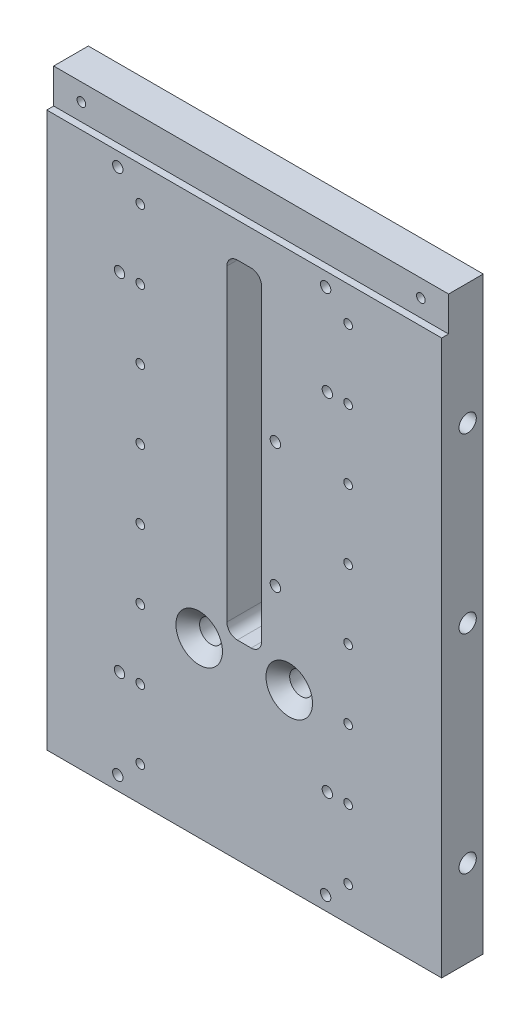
from build123d import *

# Parameters (mm, degrees)
SKETCH1_W                     = 114
SKETCH1_H                     = 170
BOSS_EXTRUDE1_DEPTH           = 6
SKETCH3_W                     = 10
SKETCH3_H                     = 95
CUT_EXTRUDE2_DEPTH            = 104.043680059
FILLET1_R                     = 3
SKETCH12_W                    = 2
SKETCH12_H                    = 10
CUT_EXTRUDE3_DEPTH            = 143.327088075
M3X0_5_TAPPED_HOLE4_D         = 2.5
M3X0_5_TAPPED_HOLE4_DEPTH     = 7.5
M3X0_5_TAPPED_HOLE4_TIP       = 0.751075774
F_3_0_3_DIAMETER_HOLE1_D      = 3
F_3_0_3_DIAMETER_HOLE3_D      = 3
M6X1_0_TAPPED_HOLE1_D         = 5
M6X1_0_TAPPED_HOLE1_DEPTH     = 15
M6X1_0_TAPPED_HOLE1_TIP       = 1.502151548
M6X1_0_TAPPED_HOLE2_D         = 5
M6X1_0_TAPPED_HOLE2_DEPTH     = 15
M6X1_0_TAPPED_HOLE2_TIP       = 1.502151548
CSK_FOR_M6_SFHCS1_D           = 6.6
CSK_FOR_M6_SFHCS1_CSINK_D     = 13.44
CSK_FOR_M6_SFHCS1_CSINK_ANGLE = 90
M3X0_5_TAPPED_HOLE2_D         = 2.5
M3X0_5_TAPPED_HOLE2_DEPTH     = 7.5
M3X0_5_TAPPED_HOLE2_TIP       = 0.751075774
M3X0_5_TAPPED_HOLE3_D         = 2.5
M3X0_5_TAPPED_HOLE3_DEPTH     = 4.3
M3X0_5_TAPPED_HOLE3_TIP       = 0.751075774
F_3_0_3_DIAMETER_HOLE4_D      = 3
F_3_0_3_DIAMETER_HOLE5_D      = 3


with BuildPart() as part:
    # Sketch1 → Boss-Extrude1 (new, symmetric)
    with BuildSketch(Plane.XY):
        Rectangle(SKETCH1_W, SKETCH1_H)
    extrude(amount=BOSS_EXTRUDE1_DEPTH, both=True)

    # Sketch3 → Cut-Extrude2 (cut, through all)
    with BuildSketch(Plane(origin=(0, 0, -6), x_dir=(-1, 0, 0), z_dir=(0, 0, -1))):
        with Locations((0, 17.5)):
            Rectangle(SKETCH3_W, SKETCH3_H)
    extrude(amount=-CUT_EXTRUDE2_DEPTH, mode=Mode.SUBTRACT)

    # Fillet1
    fillet1_edges = [part.edges().sort_by_distance(p)[0] for p in [
        (5, -30, 0),
        (5, 65, 0),
        (-5, 65, 0),
        (-5, -30, 0),
    ]]
    fillet(fillet1_edges, radius=FILLET1_R)

    # Sketch12 → Cut-Extrude3 (cut, through all)
    with BuildSketch(Plane(origin=(57, 0, 0), x_dir=(0, 0, -1), z_dir=(1, 0, 0))):
        with Locations((-5, 80)):
            Rectangle(SKETCH12_W, SKETCH12_H)
    extrude(amount=-CUT_EXTRUDE3_DEPTH, mode=Mode.SUBTRACT)

    # M3x0.5 Tapped Hole4
    with Locations(Plane.XY.offset(6)):
        with Locations((-49, 80), (49, 80)):
            Hole(M3X0_5_TAPPED_HOLE4_D / 2, depth=M3X0_5_TAPPED_HOLE4_DEPTH)
            with Locations((0, 0, -(M3X0_5_TAPPED_HOLE4_DEPTH + M3X0_5_TAPPED_HOLE4_TIP / 2))):  # 118° drill point
                Cone(0, M3X0_5_TAPPED_HOLE4_D / 2, M3X0_5_TAPPED_HOLE4_TIP, mode=Mode.SUBTRACT)

    # 3.0 _3_ Diameter Hole1 (through all)
    with Locations(Plane(origin=(0, 0, -6), x_dir=(-1, 0, 0), z_dir=(0, 0, -1))):
        with Locations((-9, -11)):
            Hole(F_3_0_3_DIAMETER_HOLE1_D / 2)

    # 3.0 _3_ Diameter Hole3 (through all)
    with Locations(Plane(origin=(0, 0, -6), x_dir=(-1, 0, 0), z_dir=(0, 0, -1))):
        with Locations((-9, 25)):
            Hole(F_3_0_3_DIAMETER_HOLE3_D / 2)

    # M6x1.0 Tapped Hole1
    with Locations(Plane(origin=(57, 0, 0), x_dir=(0, 0, -1), z_dir=(1, 0, 0))):
        with Locations((1.5, 50), (1.5, 0), (1.5, -60)):
            Hole(M6X1_0_TAPPED_HOLE1_D / 2, depth=M6X1_0_TAPPED_HOLE1_DEPTH)
            with Locations((0, 0, -(M6X1_0_TAPPED_HOLE1_DEPTH + M6X1_0_TAPPED_HOLE1_TIP / 2))):  # 118° drill point
                Cone(0, M6X1_0_TAPPED_HOLE1_D / 2, M6X1_0_TAPPED_HOLE1_TIP, mode=Mode.SUBTRACT)

    # M6x1.0 Tapped Hole2
    with Locations(Plane.ZY.offset(57)):
        with Locations((-1.5, 50), (-1.5, 0), (-1.5, -60)):
            Hole(M6X1_0_TAPPED_HOLE2_D / 2, depth=M6X1_0_TAPPED_HOLE2_DEPTH)
            with Locations((0, 0, -(M6X1_0_TAPPED_HOLE2_DEPTH + M6X1_0_TAPPED_HOLE2_TIP / 2))):  # 118° drill point
                Cone(0, M6X1_0_TAPPED_HOLE2_D / 2, M6X1_0_TAPPED_HOLE2_TIP, mode=Mode.SUBTRACT)

    # CSK for M6 SFHCS1 (through all)
    with Locations(Plane.XY.offset(6)):
        with Locations((-13, -35), (13, -35)):
            CounterSinkHole(CSK_FOR_M6_SFHCS1_D / 2, CSK_FOR_M6_SFHCS1_CSINK_D / 2, counter_sink_angle=CSK_FOR_M6_SFHCS1_CSINK_ANGLE)

    # M3x0.5 Tapped Hole2
    with Locations(Plane(origin=(0, 0, -6), x_dir=(-1, 0, 0), z_dir=(0, 0, -1))):
        with Locations((38.404204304, 57.5), (38.404204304, 17.5), (38.404204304, -22.5)):
            Hole(M3X0_5_TAPPED_HOLE2_D / 2, depth=M3X0_5_TAPPED_HOLE2_DEPTH)
            with Locations((0, 0, -(M3X0_5_TAPPED_HOLE2_DEPTH + M3X0_5_TAPPED_HOLE2_TIP / 2))):  # 118° drill point
                Cone(0, M3X0_5_TAPPED_HOLE2_D / 2, M3X0_5_TAPPED_HOLE2_TIP, mode=Mode.SUBTRACT)

    # M3x0.5 Tapped Hole3
    with Locations(Plane.XY.offset(6)):
        with Locations((-30, 65), (-30, 45), (-30, 25), (-30, 5), (-30, -15), (-30, -35), (-30, -55), (-30, -75), (30, -75), (30, -55), (30, -35), (30, -15), (30, 5), (30, 25), (30, 45), (30, 65)):
            Hole(M3X0_5_TAPPED_HOLE3_D / 2, depth=M3X0_5_TAPPED_HOLE3_DEPTH)
            with Locations((0, 0, -(M3X0_5_TAPPED_HOLE3_DEPTH + M3X0_5_TAPPED_HOLE3_TIP / 2))):  # 118° drill point
                Cone(0, M3X0_5_TAPPED_HOLE3_D / 2, M3X0_5_TAPPED_HOLE3_TIP, mode=Mode.SUBTRACT)

    # 3.0 _3_ Diameter Hole4 (through all)
    with Locations(Plane.XY.offset(6)):
        with Locations((-36, 45), (24, 45), (24, -55), (-36, -55)):
            Hole(F_3_0_3_DIAMETER_HOLE4_D / 2)

    # 3.0 _3_ Diameter Hole5 (through all)
    with Locations(Plane.XY.offset(6)):
        with Locations((-36.5, 71), (-36.5, -81), (23.5, -81), (23.5, 71)):
            Hole(F_3_0_3_DIAMETER_HOLE5_D / 2)


solid = part.part
